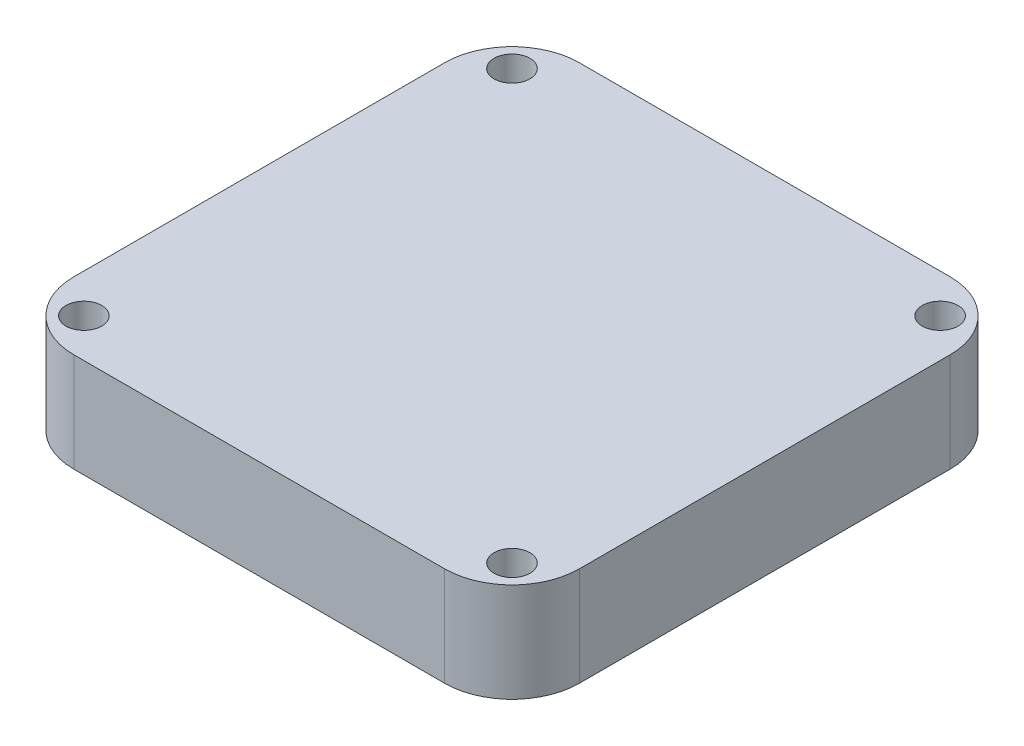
ISO-10303-21;
HEADER;
FILE_DESCRIPTION(('STEP AP214'),'2;1');
FILE_NAME('part.step','',(''),(''),'','','');
FILE_SCHEMA(('AUTOMOTIVE_DESIGN { 1 0 10303 214 1 1 1 1 }'));
ENDSEC;
DATA;
#1=APPLICATION_CONTEXT('core data for automotive mechanical design processes');
#2=APPLICATION_PROTOCOL_DEFINITION('international standard','automotive_design',2000,#1);
#3=PRODUCT_CONTEXT('',#1,'mechanical');
#4=PRODUCT('Part','Part','',(#3));
#5=PRODUCT_RELATED_PRODUCT_CATEGORY('part','',(#4));
#6=PRODUCT_DEFINITION_FORMATION('','',#4);
#7=PRODUCT_DEFINITION_CONTEXT('part definition',#1,'design');
#8=PRODUCT_DEFINITION('design','',#6,#7);
#9=PRODUCT_DEFINITION_SHAPE('','',#8);
#10=(LENGTH_UNIT() NAMED_UNIT(*) SI_UNIT(.MILLI.,.METRE.));
#11=(NAMED_UNIT(*) PLANE_ANGLE_UNIT() SI_UNIT($,.RADIAN.));
#12=(NAMED_UNIT(*) SI_UNIT($,.STERADIAN.) SOLID_ANGLE_UNIT());
#13=UNCERTAINTY_MEASURE_WITH_UNIT(LENGTH_MEASURE(1.E-05),#10,'distance_accuracy_value','');
#14=(GEOMETRIC_REPRESENTATION_CONTEXT(3) GLOBAL_UNCERTAINTY_ASSIGNED_CONTEXT((#13)) GLOBAL_UNIT_ASSIGNED_CONTEXT((#10,
#11,#12)) REPRESENTATION_CONTEXT('',''));
#15=CARTESIAN_POINT('',(0.,0.,0.));
#16=DIRECTION('',(0.,0.,1.));
#17=DIRECTION('',(1.,0.,0.));
#18=AXIS2_PLACEMENT_3D('',#15,#16,#17);
#19=CARTESIAN_POINT('',(-37.5,14.7,37.5));
#20=DIRECTION('',(1.,0.,0.));
#21=DIRECTION('',(0.,0.,-1.));
#22=AXIS2_PLACEMENT_3D('',#19,#20,#21);
#23=PLANE('',#22);
#24=DIRECTION('',(0.,0.,1.));
#25=VECTOR('',#24,1.);
#26=CARTESIAN_POINT('',(-37.5,14.7,37.5));
#27=LINE('',#26,#25);
#28=CARTESIAN_POINT('',(-37.5,14.7,-27.5));
#29=VERTEX_POINT('',#28);
#30=CARTESIAN_POINT('',(-37.5,14.7,27.5));
#31=VERTEX_POINT('',#30);
#32=EDGE_CURVE('E121',#29,#31,#27,.T.);
#33=ORIENTED_EDGE('',*,*,#32,.F.);
#34=DIRECTION('',(0.,-1.,0.));
#35=VECTOR('',#34,1.);
#36=CARTESIAN_POINT('',(-37.5,14.7,-27.5));
#37=LINE('',#36,#35);
#38=CARTESIAN_POINT('',(-37.5,0.,-27.5));
#39=VERTEX_POINT('',#38);
#40=EDGE_CURVE('E106',#29,#39,#37,.T.);
#41=ORIENTED_EDGE('',*,*,#40,.T.);
#42=DIRECTION('',(0.,0.,1.));
#43=VECTOR('',#42,1.);
#44=CARTESIAN_POINT('',(-37.5,0.,37.5));
#45=LINE('',#44,#43);
#46=CARTESIAN_POINT('',(-37.5,0.,27.5));
#47=VERTEX_POINT('',#46);
#48=EDGE_CURVE('E118',#39,#47,#45,.T.);
#49=ORIENTED_EDGE('',*,*,#48,.T.);
#50=DIRECTION('',(0.,-1.,0.));
#51=VECTOR('',#50,1.);
#52=CARTESIAN_POINT('',(-37.5,14.7,27.5));
#53=LINE('',#52,#51);
#54=EDGE_CURVE('E123',#47,#31,#53,.F.);
#55=ORIENTED_EDGE('',*,*,#54,.T.);
#56=EDGE_LOOP('',(#33,#41,#49,#55));
#57=FACE_BOUND('',#56,.T.);
#58=ADVANCED_FACE('F36',(#57),#23,.F.);
#59=CARTESIAN_POINT('',(37.5,14.7,37.5));
#60=DIRECTION('',(0.,0.,-1.));
#61=DIRECTION('',(-1.,0.,0.));
#62=AXIS2_PLACEMENT_3D('',#59,#60,#61);
#63=PLANE('',#62);
#64=DIRECTION('',(1.,0.,0.));
#65=VECTOR('',#64,1.);
#66=CARTESIAN_POINT('',(37.5,0.,37.5));
#67=LINE('',#66,#65);
#68=CARTESIAN_POINT('',(-27.5,0.,37.5));
#69=VERTEX_POINT('',#68);
#70=CARTESIAN_POINT('',(27.5,0.,37.5));
#71=VERTEX_POINT('',#70);
#72=EDGE_CURVE('E127',#69,#71,#67,.T.);
#73=ORIENTED_EDGE('',*,*,#72,.T.);
#74=DIRECTION('',(0.,-1.,0.));
#75=VECTOR('',#74,1.);
#76=CARTESIAN_POINT('',(27.5,14.7,37.5));
#77=LINE('',#76,#75);
#78=CARTESIAN_POINT('',(27.5,14.7,37.5));
#79=VERTEX_POINT('',#78);
#80=EDGE_CURVE('E11',#71,#79,#77,.F.);
#81=ORIENTED_EDGE('',*,*,#80,.T.);
#82=DIRECTION('',(1.,0.,0.));
#83=VECTOR('',#82,1.);
#84=CARTESIAN_POINT('',(37.5,14.7,37.5));
#85=LINE('',#84,#83);
#86=CARTESIAN_POINT('',(-27.5,14.7,37.5));
#87=VERTEX_POINT('',#86);
#88=EDGE_CURVE('E167',#87,#79,#85,.T.);
#89=ORIENTED_EDGE('',*,*,#88,.F.);
#90=DIRECTION('',(0.,-1.,0.));
#91=VECTOR('',#90,1.);
#92=CARTESIAN_POINT('',(-27.5,14.7,37.5));
#93=LINE('',#92,#91);
#94=EDGE_CURVE('E44',#87,#69,#93,.T.);
#95=ORIENTED_EDGE('',*,*,#94,.T.);
#96=EDGE_LOOP('',(#73,#81,#89,#95));
#97=FACE_BOUND('',#96,.T.);
#98=ADVANCED_FACE('F165',(#97),#63,.F.);
#99=CARTESIAN_POINT('',(37.5,14.7,37.5));
#100=DIRECTION('',(-1.,0.,0.));
#101=DIRECTION('',(0.,0.,1.));
#102=AXIS2_PLACEMENT_3D('',#99,#100,#101);
#103=PLANE('',#102);
#104=DIRECTION('',(0.,0.,-1.));
#105=VECTOR('',#104,1.);
#106=CARTESIAN_POINT('',(37.5,0.,37.5));
#107=LINE('',#106,#105);
#108=CARTESIAN_POINT('',(37.5,0.,27.5));
#109=VERTEX_POINT('',#108);
#110=CARTESIAN_POINT('',(37.5,0.,-27.5));
#111=VERTEX_POINT('',#110);
#112=EDGE_CURVE('E131',#109,#111,#107,.T.);
#113=ORIENTED_EDGE('',*,*,#112,.T.);
#114=DIRECTION('',(0.,-1.,0.));
#115=VECTOR('',#114,1.);
#116=CARTESIAN_POINT('',(37.5,14.7,-27.5));
#117=LINE('',#116,#115);
#118=CARTESIAN_POINT('',(37.5,14.7,-27.5));
#119=VERTEX_POINT('',#118);
#120=EDGE_CURVE('E51',#111,#119,#117,.F.);
#121=ORIENTED_EDGE('',*,*,#120,.T.);
#122=DIRECTION('',(0.,0.,-1.));
#123=VECTOR('',#122,1.);
#124=CARTESIAN_POINT('',(37.5,14.7,37.5));
#125=LINE('',#124,#123);
#126=CARTESIAN_POINT('',(37.5,14.7,27.5));
#127=VERTEX_POINT('',#126);
#128=EDGE_CURVE('E175',#127,#119,#125,.T.);
#129=ORIENTED_EDGE('',*,*,#128,.F.);
#130=DIRECTION('',(0.,-1.,0.));
#131=VECTOR('',#130,1.);
#132=CARTESIAN_POINT('',(37.5,14.7,27.5));
#133=LINE('',#132,#131);
#134=EDGE_CURVE('E158',#127,#109,#133,.T.);
#135=ORIENTED_EDGE('',*,*,#134,.T.);
#136=EDGE_LOOP('',(#113,#121,#129,#135));
#137=FACE_BOUND('',#136,.T.);
#138=ADVANCED_FACE('F174',(#137),#103,.F.);
#139=CARTESIAN_POINT('',(37.5,14.7,-37.5));
#140=DIRECTION('',(0.,0.,1.));
#141=DIRECTION('',(1.,0.,0.));
#142=AXIS2_PLACEMENT_3D('',#139,#140,#141);
#143=PLANE('',#142);
#144=DIRECTION('',(-1.,0.,0.));
#145=VECTOR('',#144,1.);
#146=CARTESIAN_POINT('',(37.5,0.,-37.5));
#147=LINE('',#146,#145);
#148=CARTESIAN_POINT('',(27.5,0.,-37.5));
#149=VERTEX_POINT('',#148);
#150=CARTESIAN_POINT('',(-27.5,0.,-37.5));
#151=VERTEX_POINT('',#150);
#152=EDGE_CURVE('E141',#149,#151,#147,.T.);
#153=ORIENTED_EDGE('',*,*,#152,.T.);
#154=DIRECTION('',(0.,-1.,0.));
#155=VECTOR('',#154,1.);
#156=CARTESIAN_POINT('',(-27.5,14.7,-37.5));
#157=LINE('',#156,#155);
#158=CARTESIAN_POINT('',(-27.5,14.7,-37.5));
#159=VERTEX_POINT('',#158);
#160=EDGE_CURVE('E107',#151,#159,#157,.F.);
#161=ORIENTED_EDGE('',*,*,#160,.T.);
#162=DIRECTION('',(-1.,0.,0.));
#163=VECTOR('',#162,1.);
#164=CARTESIAN_POINT('',(37.5,14.7,-37.5));
#165=LINE('',#164,#163);
#166=CARTESIAN_POINT('',(27.5,14.7,-37.5));
#167=VERTEX_POINT('',#166);
#168=EDGE_CURVE('E137',#167,#159,#165,.T.);
#169=ORIENTED_EDGE('',*,*,#168,.F.);
#170=DIRECTION('',(0.,-1.,0.));
#171=VECTOR('',#170,1.);
#172=CARTESIAN_POINT('',(27.5,14.7,-37.5));
#173=LINE('',#172,#171);
#174=EDGE_CURVE('E112',#167,#149,#173,.T.);
#175=ORIENTED_EDGE('',*,*,#174,.T.);
#176=EDGE_LOOP('',(#153,#161,#169,#175));
#177=FACE_BOUND('',#176,.T.);
#178=ADVANCED_FACE('F207',(#177),#143,.F.);
#179=CARTESIAN_POINT('',(0.,14.7,0.));
#180=DIRECTION('',(0.,1.,0.));
#181=DIRECTION('',(0.,0.,1.));
#182=AXIS2_PLACEMENT_3D('',#179,#180,#181);
#183=PLANE('',#182);
#184=CARTESIAN_POINT('',(-31.75,14.7,-31.75));
#185=DIRECTION('',(0.,1.,0.));
#186=DIRECTION('',(0.,0.,1.));
#187=AXIS2_PLACEMENT_3D('',#184,#185,#186);
#188=CIRCLE('',#187,2.6543);
#189=CARTESIAN_POINT('',(-31.75,14.7,-29.0957));
#190=VERTEX_POINT('',#189);
#191=EDGE_CURVE('E198',#190,#190,#188,.T.);
#192=ORIENTED_EDGE('',*,*,#191,.F.);
#193=EDGE_LOOP('',(#192));
#194=FACE_BOUND('',#193,.T.);
#195=CARTESIAN_POINT('',(31.75,14.7,31.75));
#196=DIRECTION('',(0.,1.,0.));
#197=DIRECTION('',(0.,0.,1.));
#198=AXIS2_PLACEMENT_3D('',#195,#196,#197);
#199=CIRCLE('',#198,2.6543);
#200=CARTESIAN_POINT('',(31.75,14.7,34.4043));
#201=VERTEX_POINT('',#200);
#202=EDGE_CURVE('E192',#201,#201,#199,.T.);
#203=ORIENTED_EDGE('',*,*,#202,.F.);
#204=EDGE_LOOP('',(#203));
#205=FACE_BOUND('',#204,.T.);
#206=CARTESIAN_POINT('',(31.75,14.7,-31.75));
#207=DIRECTION('',(0.,1.,0.));
#208=DIRECTION('',(0.,0.,1.));
#209=AXIS2_PLACEMENT_3D('',#206,#207,#208);
#210=CIRCLE('',#209,2.6543);
#211=CARTESIAN_POINT('',(31.75,14.7,-29.0957));
#212=VERTEX_POINT('',#211);
#213=EDGE_CURVE('E186',#212,#212,#210,.T.);
#214=ORIENTED_EDGE('',*,*,#213,.F.);
#215=EDGE_LOOP('',(#214));
#216=FACE_BOUND('',#215,.T.);
#217=CARTESIAN_POINT('',(-31.75,14.7,31.75));
#218=DIRECTION('',(0.,1.,0.));
#219=DIRECTION('',(0.,0.,1.));
#220=AXIS2_PLACEMENT_3D('',#217,#218,#219);
#221=CIRCLE('',#220,2.6543);
#222=CARTESIAN_POINT('',(-31.75,14.7,34.4043));
#223=VERTEX_POINT('',#222);
#224=EDGE_CURVE('E134',#223,#223,#221,.T.);
#225=ORIENTED_EDGE('',*,*,#224,.F.);
#226=EDGE_LOOP('',(#225));
#227=FACE_BOUND('',#226,.T.);
#228=ORIENTED_EDGE('',*,*,#168,.T.);
#229=CARTESIAN_POINT('',(-27.5,14.7,-27.5));
#230=DIRECTION('',(0.,1.,0.));
#231=DIRECTION('',(0.,0.,1.));
#232=AXIS2_PLACEMENT_3D('',#229,#230,#231);
#233=CIRCLE('',#232,10.);
#234=EDGE_CURVE('E156',#159,#29,#233,.T.);
#235=ORIENTED_EDGE('',*,*,#234,.T.);
#236=ORIENTED_EDGE('',*,*,#32,.T.);
#237=CARTESIAN_POINT('',(-27.5,14.7,27.5));
#238=DIRECTION('',(0.,1.,0.));
#239=DIRECTION('',(0.,0.,1.));
#240=AXIS2_PLACEMENT_3D('',#237,#238,#239);
#241=CIRCLE('',#240,10.);
#242=EDGE_CURVE('E151',#31,#87,#241,.T.);
#243=ORIENTED_EDGE('',*,*,#242,.T.);
#244=ORIENTED_EDGE('',*,*,#88,.T.);
#245=CARTESIAN_POINT('',(27.5,14.7,27.5));
#246=DIRECTION('',(0.,1.,0.));
#247=DIRECTION('',(0.,0.,1.));
#248=AXIS2_PLACEMENT_3D('',#245,#246,#247);
#249=CIRCLE('',#248,10.);
#250=EDGE_CURVE('E58',#79,#127,#249,.T.);
#251=ORIENTED_EDGE('',*,*,#250,.T.);
#252=ORIENTED_EDGE('',*,*,#128,.T.);
#253=CARTESIAN_POINT('',(27.5,14.7,-27.5));
#254=DIRECTION('',(0.,1.,0.));
#255=DIRECTION('',(0.,0.,1.));
#256=AXIS2_PLACEMENT_3D('',#253,#254,#255);
#257=CIRCLE('',#256,10.);
#258=EDGE_CURVE('E154',#119,#167,#257,.T.);
#259=ORIENTED_EDGE('',*,*,#258,.T.);
#260=EDGE_LOOP('',(#228,#235,#236,#243,#244,#251,#252,#259));
#261=FACE_BOUND('',#260,.T.);
#262=ADVANCED_FACE('F204',(#194,#205,#216,#227,#261),#183,.T.);
#263=CARTESIAN_POINT('',(0.,0.,0.));
#264=DIRECTION('',(0.,1.,0.));
#265=DIRECTION('',(0.,0.,1.));
#266=AXIS2_PLACEMENT_3D('',#263,#264,#265);
#267=PLANE('',#266);
#268=CARTESIAN_POINT('',(-31.75,0.,-31.75));
#269=DIRECTION('',(0.,1.,0.));
#270=DIRECTION('',(0.,0.,1.));
#271=AXIS2_PLACEMENT_3D('',#268,#269,#270);
#272=CIRCLE('',#271,2.65429999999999);
#273=CARTESIAN_POINT('',(-31.75,0.,-29.0957));
#274=VERTEX_POINT('',#273);
#275=EDGE_CURVE('E195',#274,#274,#272,.T.);
#276=ORIENTED_EDGE('',*,*,#275,.T.);
#277=EDGE_LOOP('',(#276));
#278=FACE_BOUND('',#277,.T.);
#279=CARTESIAN_POINT('',(31.75,0.,31.75));
#280=DIRECTION('',(0.,1.,0.));
#281=DIRECTION('',(0.,0.,1.));
#282=AXIS2_PLACEMENT_3D('',#279,#280,#281);
#283=CIRCLE('',#282,2.6543);
#284=CARTESIAN_POINT('',(31.75,0.,34.4043));
#285=VERTEX_POINT('',#284);
#286=EDGE_CURVE('E189',#285,#285,#283,.T.);
#287=ORIENTED_EDGE('',*,*,#286,.T.);
#288=EDGE_LOOP('',(#287));
#289=FACE_BOUND('',#288,.T.);
#290=CARTESIAN_POINT('',(31.75,0.,-31.75));
#291=DIRECTION('',(0.,1.,0.));
#292=DIRECTION('',(0.,0.,1.));
#293=AXIS2_PLACEMENT_3D('',#290,#291,#292);
#294=CIRCLE('',#293,2.6543);
#295=CARTESIAN_POINT('',(31.75,0.,-29.0957));
#296=VERTEX_POINT('',#295);
#297=EDGE_CURVE('E183',#296,#296,#294,.T.);
#298=ORIENTED_EDGE('',*,*,#297,.T.);
#299=EDGE_LOOP('',(#298));
#300=FACE_BOUND('',#299,.T.);
#301=CARTESIAN_POINT('',(-31.75,0.,31.75));
#302=DIRECTION('',(0.,1.,0.));
#303=DIRECTION('',(0.,0.,1.));
#304=AXIS2_PLACEMENT_3D('',#301,#302,#303);
#305=CIRCLE('',#304,2.65429999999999);
#306=CARTESIAN_POINT('',(-31.75,0.,34.4043));
#307=VERTEX_POINT('',#306);
#308=EDGE_CURVE('E128',#307,#307,#305,.T.);
#309=ORIENTED_EDGE('',*,*,#308,.T.);
#310=EDGE_LOOP('',(#309));
#311=FACE_BOUND('',#310,.T.);
#312=ORIENTED_EDGE('',*,*,#48,.F.);
#313=CARTESIAN_POINT('',(-27.5,0.,-27.5));
#314=DIRECTION('',(0.,1.,0.));
#315=DIRECTION('',(0.,0.,1.));
#316=AXIS2_PLACEMENT_3D('',#313,#314,#315);
#317=CIRCLE('',#316,10.);
#318=EDGE_CURVE('E102',#39,#151,#317,.F.);
#319=ORIENTED_EDGE('',*,*,#318,.T.);
#320=ORIENTED_EDGE('',*,*,#152,.F.);
#321=CARTESIAN_POINT('',(27.5,0.,-27.5));
#322=DIRECTION('',(0.,1.,0.));
#323=DIRECTION('',(0.,0.,1.));
#324=AXIS2_PLACEMENT_3D('',#321,#322,#323);
#325=CIRCLE('',#324,10.);
#326=EDGE_CURVE('E113',#149,#111,#325,.F.);
#327=ORIENTED_EDGE('',*,*,#326,.T.);
#328=ORIENTED_EDGE('',*,*,#112,.F.);
#329=CARTESIAN_POINT('',(27.5,0.,27.5));
#330=DIRECTION('',(0.,1.,0.));
#331=DIRECTION('',(0.,0.,1.));
#332=AXIS2_PLACEMENT_3D('',#329,#330,#331);
#333=CIRCLE('',#332,10.);
#334=EDGE_CURVE('E145',#109,#71,#333,.F.);
#335=ORIENTED_EDGE('',*,*,#334,.T.);
#336=ORIENTED_EDGE('',*,*,#72,.F.);
#337=CARTESIAN_POINT('',(-27.5,0.,27.5));
#338=DIRECTION('',(0.,1.,0.));
#339=DIRECTION('',(0.,0.,1.));
#340=AXIS2_PLACEMENT_3D('',#337,#338,#339);
#341=CIRCLE('',#340,10.);
#342=EDGE_CURVE('E122',#69,#47,#341,.F.);
#343=ORIENTED_EDGE('',*,*,#342,.T.);
#344=EDGE_LOOP('',(#312,#319,#320,#327,#328,#335,#336,#343));
#345=FACE_BOUND('',#344,.T.);
#346=ADVANCED_FACE('F125',(#278,#289,#300,#311,#345),#267,.F.);
#347=CARTESIAN_POINT('',(-31.75,14.7,31.75));
#348=DIRECTION('',(0.,1.,0.));
#349=DIRECTION('',(0.,0.,1.));
#350=AXIS2_PLACEMENT_3D('',#347,#348,#349);
#351=CYLINDRICAL_SURFACE('',#350,2.6543);
#352=ORIENTED_EDGE('',*,*,#308,.F.);
#353=EDGE_LOOP('',(#352));
#354=FACE_BOUND('',#353,.T.);
#355=ORIENTED_EDGE('',*,*,#224,.T.);
#356=EDGE_LOOP('',(#355));
#357=FACE_BOUND('',#356,.T.);
#358=ADVANCED_FACE('F238',(#354,#357),#351,.F.);
#359=CARTESIAN_POINT('',(31.75,14.7,-31.75));
#360=DIRECTION('',(0.,1.,0.));
#361=DIRECTION('',(0.,0.,1.));
#362=AXIS2_PLACEMENT_3D('',#359,#360,#361);
#363=CYLINDRICAL_SURFACE('',#362,2.6543);
#364=ORIENTED_EDGE('',*,*,#297,.F.);
#365=EDGE_LOOP('',(#364));
#366=FACE_BOUND('',#365,.T.);
#367=ORIENTED_EDGE('',*,*,#213,.T.);
#368=EDGE_LOOP('',(#367));
#369=FACE_BOUND('',#368,.T.);
#370=ADVANCED_FACE('F243',(#366,#369),#363,.F.);
#371=CARTESIAN_POINT('',(31.75,14.7,31.75));
#372=DIRECTION('',(0.,1.,0.));
#373=DIRECTION('',(0.,0.,1.));
#374=AXIS2_PLACEMENT_3D('',#371,#372,#373);
#375=CYLINDRICAL_SURFACE('',#374,2.6543);
#376=ORIENTED_EDGE('',*,*,#286,.F.);
#377=EDGE_LOOP('',(#376));
#378=FACE_BOUND('',#377,.T.);
#379=ORIENTED_EDGE('',*,*,#202,.T.);
#380=EDGE_LOOP('',(#379));
#381=FACE_BOUND('',#380,.T.);
#382=ADVANCED_FACE('F247',(#378,#381),#375,.F.);
#383=CARTESIAN_POINT('',(-31.75,14.7,-31.75));
#384=DIRECTION('',(0.,1.,0.));
#385=DIRECTION('',(0.,0.,1.));
#386=AXIS2_PLACEMENT_3D('',#383,#384,#385);
#387=CYLINDRICAL_SURFACE('',#386,2.6543);
#388=ORIENTED_EDGE('',*,*,#275,.F.);
#389=EDGE_LOOP('',(#388));
#390=FACE_BOUND('',#389,.T.);
#391=ORIENTED_EDGE('',*,*,#191,.T.);
#392=EDGE_LOOP('',(#391));
#393=FACE_BOUND('',#392,.T.);
#394=ADVANCED_FACE('F202',(#390,#393),#387,.F.);
#395=CARTESIAN_POINT('',(-27.5,14.7,-27.5));
#396=DIRECTION('',(0.,-1.,0.));
#397=DIRECTION('',(0.,0.,-1.));
#398=AXIS2_PLACEMENT_3D('',#395,#396,#397);
#399=CYLINDRICAL_SURFACE('',#398,10.);
#400=ORIENTED_EDGE('',*,*,#234,.F.);
#401=ORIENTED_EDGE('',*,*,#160,.F.);
#402=ORIENTED_EDGE('',*,*,#318,.F.);
#403=ORIENTED_EDGE('',*,*,#40,.F.);
#404=EDGE_LOOP('',(#400,#401,#402,#403));
#405=FACE_BOUND('',#404,.T.);
#406=ADVANCED_FACE('F105',(#405),#399,.T.);
#407=CARTESIAN_POINT('',(27.5,14.7,-27.5));
#408=DIRECTION('',(0.,-1.,0.));
#409=DIRECTION('',(0.,0.,-1.));
#410=AXIS2_PLACEMENT_3D('',#407,#408,#409);
#411=CYLINDRICAL_SURFACE('',#410,10.);
#412=ORIENTED_EDGE('',*,*,#258,.F.);
#413=ORIENTED_EDGE('',*,*,#120,.F.);
#414=ORIENTED_EDGE('',*,*,#326,.F.);
#415=ORIENTED_EDGE('',*,*,#174,.F.);
#416=EDGE_LOOP('',(#412,#413,#414,#415));
#417=FACE_BOUND('',#416,.T.);
#418=ADVANCED_FACE('F218',(#417),#411,.T.);
#419=CARTESIAN_POINT('',(27.5,14.7,27.5));
#420=DIRECTION('',(0.,-1.,0.));
#421=DIRECTION('',(0.,0.,-1.));
#422=AXIS2_PLACEMENT_3D('',#419,#420,#421);
#423=CYLINDRICAL_SURFACE('',#422,10.);
#424=ORIENTED_EDGE('',*,*,#250,.F.);
#425=ORIENTED_EDGE('',*,*,#80,.F.);
#426=ORIENTED_EDGE('',*,*,#334,.F.);
#427=ORIENTED_EDGE('',*,*,#134,.F.);
#428=EDGE_LOOP('',(#424,#425,#426,#427));
#429=FACE_BOUND('',#428,.T.);
#430=ADVANCED_FACE('F173',(#429),#423,.T.);
#431=CARTESIAN_POINT('',(-27.5,14.7,27.5));
#432=DIRECTION('',(0.,-1.,0.));
#433=DIRECTION('',(0.,0.,-1.));
#434=AXIS2_PLACEMENT_3D('',#431,#432,#433);
#435=CYLINDRICAL_SURFACE('',#434,10.);
#436=ORIENTED_EDGE('',*,*,#242,.F.);
#437=ORIENTED_EDGE('',*,*,#54,.F.);
#438=ORIENTED_EDGE('',*,*,#342,.F.);
#439=ORIENTED_EDGE('',*,*,#94,.F.);
#440=EDGE_LOOP('',(#436,#437,#438,#439));
#441=FACE_BOUND('',#440,.T.);
#442=ADVANCED_FACE('F38',(#441),#435,.T.);
#443=CLOSED_SHELL('',(#58,#98,#138,#178,#262,#346,#358,#370,#382,#394,#406,#418,#430,#442));
#444=MANIFOLD_SOLID_BREP('B2',#443);
#445=ADVANCED_BREP_SHAPE_REPRESENTATION('',(#18,#444),#14);
#446=SHAPE_DEFINITION_REPRESENTATION(#9,#445);
ENDSEC;
END-ISO-10303-21;
